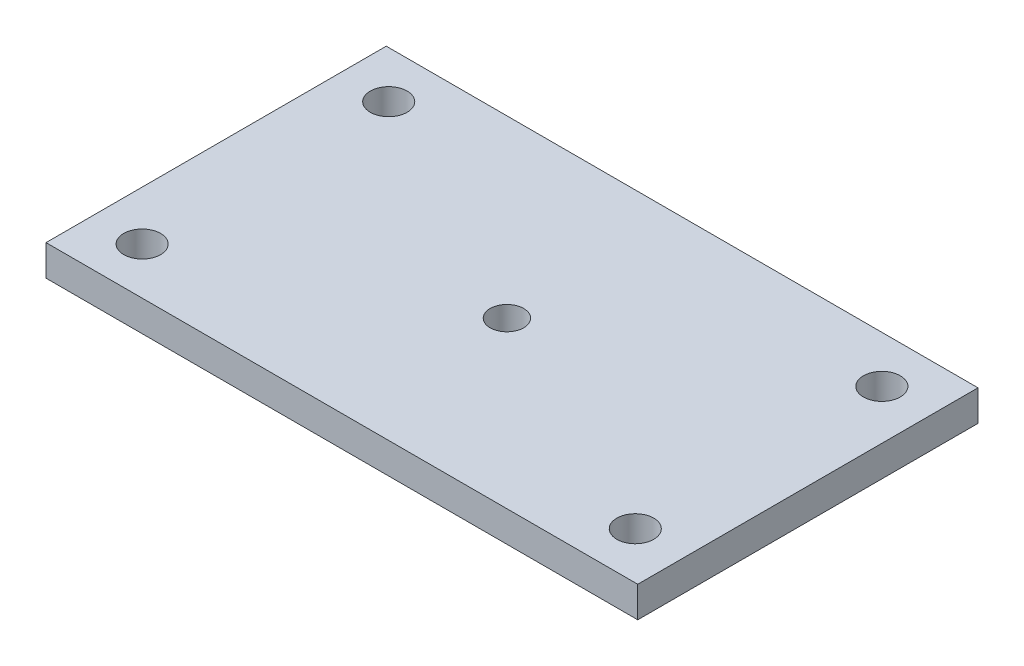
ISO-10303-21;
HEADER;
FILE_DESCRIPTION(('STEP AP214'),'2;1');
FILE_NAME('part.step','',(''),(''),'','','');
FILE_SCHEMA(('AUTOMOTIVE_DESIGN { 1 0 10303 214 1 1 1 1 }'));
ENDSEC;
DATA;
#1=APPLICATION_CONTEXT('core data for automotive mechanical design processes');
#2=APPLICATION_PROTOCOL_DEFINITION('international standard','automotive_design',2000,#1);
#3=PRODUCT_CONTEXT('',#1,'mechanical');
#4=PRODUCT('Part','Part','',(#3));
#5=PRODUCT_RELATED_PRODUCT_CATEGORY('part','',(#4));
#6=PRODUCT_DEFINITION_FORMATION('','',#4);
#7=PRODUCT_DEFINITION_CONTEXT('part definition',#1,'design');
#8=PRODUCT_DEFINITION('design','',#6,#7);
#9=PRODUCT_DEFINITION_SHAPE('','',#8);
#10=(LENGTH_UNIT() NAMED_UNIT(*) SI_UNIT(.MILLI.,.METRE.));
#11=(NAMED_UNIT(*) PLANE_ANGLE_UNIT() SI_UNIT($,.RADIAN.));
#12=(NAMED_UNIT(*) SI_UNIT($,.STERADIAN.) SOLID_ANGLE_UNIT());
#13=UNCERTAINTY_MEASURE_WITH_UNIT(LENGTH_MEASURE(1.E-05),#10,'distance_accuracy_value','');
#14=(GEOMETRIC_REPRESENTATION_CONTEXT(3) GLOBAL_UNCERTAINTY_ASSIGNED_CONTEXT((#13)) GLOBAL_UNIT_ASSIGNED_CONTEXT((#10,
#11,#12)) REPRESENTATION_CONTEXT('',''));
#15=CARTESIAN_POINT('',(0.,0.,0.));
#16=DIRECTION('',(0.,0.,1.));
#17=DIRECTION('',(1.,0.,0.));
#18=AXIS2_PLACEMENT_3D('',#15,#16,#17);
#19=CARTESIAN_POINT('',(-56.9504921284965,3.175,-18.0498827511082));
#20=DIRECTION('',(1.,0.,0.));
#21=DIRECTION('',(0.,0.,-1.));
#22=AXIS2_PLACEMENT_3D('',#19,#20,#21);
#23=PLANE('',#22);
#24=DIRECTION('',(0.,0.,1.));
#25=VECTOR('',#24,1.);
#26=CARTESIAN_POINT('',(-56.9504921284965,0.,-18.0498827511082));
#27=LINE('',#26,#25);
#28=CARTESIAN_POINT('',(-56.9504921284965,0.,-18.0498827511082));
#29=VERTEX_POINT('',#28);
#30=CARTESIAN_POINT('',(-56.9504921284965,0.,17.0021172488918));
#31=VERTEX_POINT('',#30);
#32=EDGE_CURVE('E105',#29,#31,#27,.T.);
#33=ORIENTED_EDGE('',*,*,#32,.T.);
#34=DIRECTION('',(0.,-1.,0.));
#35=VECTOR('',#34,1.);
#36=CARTESIAN_POINT('',(-56.9504921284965,3.175,17.0021172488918));
#37=LINE('',#36,#35);
#38=CARTESIAN_POINT('',(-56.9504921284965,3.175,17.0021172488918));
#39=VERTEX_POINT('',#38);
#40=EDGE_CURVE('E11',#39,#31,#37,.T.);
#41=ORIENTED_EDGE('',*,*,#40,.F.);
#42=DIRECTION('',(0.,0.,1.));
#43=VECTOR('',#42,1.);
#44=CARTESIAN_POINT('',(-56.9504921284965,3.175,-18.0498827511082));
#45=LINE('',#44,#43);
#46=CARTESIAN_POINT('',(-56.9504921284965,3.175,-18.0498827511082));
#47=VERTEX_POINT('',#46);
#48=EDGE_CURVE('E93',#47,#39,#45,.T.);
#49=ORIENTED_EDGE('',*,*,#48,.F.);
#50=DIRECTION('',(0.,-1.,0.));
#51=VECTOR('',#50,1.);
#52=CARTESIAN_POINT('',(-56.9504921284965,3.175,-18.0498827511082));
#53=LINE('',#52,#51);
#54=EDGE_CURVE('E101',#47,#29,#53,.T.);
#55=ORIENTED_EDGE('',*,*,#54,.T.);
#56=EDGE_LOOP('',(#33,#41,#49,#55));
#57=FACE_BOUND('',#56,.T.);
#58=ADVANCED_FACE('F42',(#57),#23,.F.);
#59=CARTESIAN_POINT('',(-56.9504921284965,3.175,17.0021172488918));
#60=DIRECTION('',(0.,0.,-1.));
#61=DIRECTION('',(-1.,0.,0.));
#62=AXIS2_PLACEMENT_3D('',#59,#60,#61);
#63=PLANE('',#62);
#64=DIRECTION('',(1.,0.,0.));
#65=VECTOR('',#64,1.);
#66=CARTESIAN_POINT('',(-56.9504921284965,0.,17.0021172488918));
#67=LINE('',#66,#65);
#68=CARTESIAN_POINT('',(4.00950787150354,0.,17.0021172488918));
#69=VERTEX_POINT('',#68);
#70=EDGE_CURVE('E97',#31,#69,#67,.T.);
#71=ORIENTED_EDGE('',*,*,#70,.T.);
#72=DIRECTION('',(0.,-1.,0.));
#73=VECTOR('',#72,1.);
#74=CARTESIAN_POINT('',(4.00950787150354,3.175,17.0021172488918));
#75=LINE('',#74,#73);
#76=CARTESIAN_POINT('',(4.00950787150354,3.175,17.0021172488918));
#77=VERTEX_POINT('',#76);
#78=EDGE_CURVE('E50',#77,#69,#75,.T.);
#79=ORIENTED_EDGE('',*,*,#78,.F.);
#80=DIRECTION('',(1.,0.,0.));
#81=VECTOR('',#80,1.);
#82=CARTESIAN_POINT('',(-56.9504921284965,3.175,17.0021172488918));
#83=LINE('',#82,#81);
#84=EDGE_CURVE('E88',#39,#77,#83,.T.);
#85=ORIENTED_EDGE('',*,*,#84,.F.);
#86=ORIENTED_EDGE('',*,*,#40,.T.);
#87=EDGE_LOOP('',(#71,#79,#85,#86));
#88=FACE_BOUND('',#87,.T.);
#89=ADVANCED_FACE('F96',(#88),#63,.F.);
#90=CARTESIAN_POINT('',(4.00950787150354,3.175,-18.0498827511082));
#91=DIRECTION('',(-1.,0.,0.));
#92=DIRECTION('',(0.,0.,1.));
#93=AXIS2_PLACEMENT_3D('',#90,#91,#92);
#94=PLANE('',#93);
#95=DIRECTION('',(0.,0.,-1.));
#96=VECTOR('',#95,1.);
#97=CARTESIAN_POINT('',(4.00950787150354,0.,-18.0498827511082));
#98=LINE('',#97,#96);
#99=CARTESIAN_POINT('',(4.00950787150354,0.,-18.0498827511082));
#100=VERTEX_POINT('',#99);
#101=EDGE_CURVE('E75',#69,#100,#98,.T.);
#102=ORIENTED_EDGE('',*,*,#101,.T.);
#103=DIRECTION('',(0.,-1.,0.));
#104=VECTOR('',#103,1.);
#105=CARTESIAN_POINT('',(4.00950787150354,3.175,-18.0498827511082));
#106=LINE('',#105,#104);
#107=CARTESIAN_POINT('',(4.00950787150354,3.175,-18.0498827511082));
#108=VERTEX_POINT('',#107);
#109=EDGE_CURVE('E98',#108,#100,#106,.T.);
#110=ORIENTED_EDGE('',*,*,#109,.F.);
#111=DIRECTION('',(0.,0.,-1.));
#112=VECTOR('',#111,1.);
#113=CARTESIAN_POINT('',(4.00950787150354,3.175,-18.0498827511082));
#114=LINE('',#113,#112);
#115=EDGE_CURVE('E91',#77,#108,#114,.T.);
#116=ORIENTED_EDGE('',*,*,#115,.F.);
#117=ORIENTED_EDGE('',*,*,#78,.T.);
#118=EDGE_LOOP('',(#102,#110,#116,#117));
#119=FACE_BOUND('',#118,.T.);
#120=ADVANCED_FACE('F99',(#119),#94,.F.);
#121=CARTESIAN_POINT('',(-56.9504921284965,3.175,-18.0498827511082));
#122=DIRECTION('',(0.,0.,1.));
#123=DIRECTION('',(1.,0.,0.));
#124=AXIS2_PLACEMENT_3D('',#121,#122,#123);
#125=PLANE('',#124);
#126=DIRECTION('',(-1.,0.,0.));
#127=VECTOR('',#126,1.);
#128=CARTESIAN_POINT('',(-56.9504921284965,0.,-18.0498827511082));
#129=LINE('',#128,#127);
#130=EDGE_CURVE('E81',#100,#29,#129,.T.);
#131=ORIENTED_EDGE('',*,*,#130,.T.);
#132=ORIENTED_EDGE('',*,*,#54,.F.);
#133=DIRECTION('',(-1.,0.,0.));
#134=VECTOR('',#133,1.);
#135=CARTESIAN_POINT('',(-56.9504921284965,3.175,-18.0498827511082));
#136=LINE('',#135,#134);
#137=EDGE_CURVE('E58',#108,#47,#136,.T.);
#138=ORIENTED_EDGE('',*,*,#137,.F.);
#139=ORIENTED_EDGE('',*,*,#109,.T.);
#140=EDGE_LOOP('',(#131,#132,#138,#139));
#141=FACE_BOUND('',#140,.T.);
#142=ADVANCED_FACE('F113',(#141),#125,.F.);
#143=CARTESIAN_POINT('',(0.,3.175,0.));
#144=DIRECTION('',(0.,1.,0.));
#145=DIRECTION('',(0.,0.,1.));
#146=AXIS2_PLACEMENT_3D('',#143,#144,#145);
#147=PLANE('',#146);
#148=CARTESIAN_POINT('',(-26.4704921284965,3.175,0.));
#149=DIRECTION('',(0.,-1.,0.));
#150=DIRECTION('',(0.,0.,-1.));
#151=AXIS2_PLACEMENT_3D('',#148,#149,#150);
#152=CIRCLE('',#151,1.7272);
#153=CARTESIAN_POINT('',(-26.4704921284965,3.175,-1.7272));
#154=VERTEX_POINT('',#153);
#155=EDGE_CURVE('E142',#154,#154,#152,.T.);
#156=ORIENTED_EDGE('',*,*,#155,.T.);
#157=EDGE_LOOP('',(#156));
#158=FACE_BOUND('',#157,.T.);
#159=CARTESIAN_POINT('',(-51.8704921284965,3.175,-13.2238827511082));
#160=DIRECTION('',(0.,1.,0.));
#161=DIRECTION('',(0.,0.,1.));
#162=AXIS2_PLACEMENT_3D('',#159,#160,#161);
#163=CIRCLE('',#162,1.89865);
#164=CARTESIAN_POINT('',(-51.8704921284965,3.175,-11.3252327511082));
#165=VERTEX_POINT('',#164);
#166=EDGE_CURVE('E139',#165,#165,#163,.T.);
#167=ORIENTED_EDGE('',*,*,#166,.F.);
#168=EDGE_LOOP('',(#167));
#169=FACE_BOUND('',#168,.T.);
#170=CARTESIAN_POINT('',(-1.07049212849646,3.175,-13.2238827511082));
#171=DIRECTION('',(0.,1.,0.));
#172=DIRECTION('',(0.,0.,1.));
#173=AXIS2_PLACEMENT_3D('',#170,#171,#172);
#174=CIRCLE('',#173,1.89865);
#175=CARTESIAN_POINT('',(-1.07049212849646,3.175,-11.3252327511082));
#176=VERTEX_POINT('',#175);
#177=EDGE_CURVE('E133',#176,#176,#174,.T.);
#178=ORIENTED_EDGE('',*,*,#177,.F.);
#179=EDGE_LOOP('',(#178));
#180=FACE_BOUND('',#179,.T.);
#181=CARTESIAN_POINT('',(-1.07049212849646,3.175,12.1761172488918));
#182=DIRECTION('',(0.,1.,0.));
#183=DIRECTION('',(0.,0.,1.));
#184=AXIS2_PLACEMENT_3D('',#181,#182,#183);
#185=CIRCLE('',#184,1.89865);
#186=CARTESIAN_POINT('',(-1.07049212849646,3.175,14.0747672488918));
#187=VERTEX_POINT('',#186);
#188=EDGE_CURVE('E127',#187,#187,#185,.T.);
#189=ORIENTED_EDGE('',*,*,#188,.F.);
#190=EDGE_LOOP('',(#189));
#191=FACE_BOUND('',#190,.T.);
#192=CARTESIAN_POINT('',(-51.8704921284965,3.175,12.1761172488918));
#193=DIRECTION('',(0.,1.,0.));
#194=DIRECTION('',(0.,0.,1.));
#195=AXIS2_PLACEMENT_3D('',#192,#193,#194);
#196=CIRCLE('',#195,1.89865);
#197=CARTESIAN_POINT('',(-51.8704921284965,3.175,14.0747672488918));
#198=VERTEX_POINT('',#197);
#199=EDGE_CURVE('E121',#198,#198,#196,.T.);
#200=ORIENTED_EDGE('',*,*,#199,.F.);
#201=EDGE_LOOP('',(#200));
#202=FACE_BOUND('',#201,.T.);
#203=ORIENTED_EDGE('',*,*,#48,.T.);
#204=ORIENTED_EDGE('',*,*,#84,.T.);
#205=ORIENTED_EDGE('',*,*,#115,.T.);
#206=ORIENTED_EDGE('',*,*,#137,.T.);
#207=EDGE_LOOP('',(#203,#204,#205,#206));
#208=FACE_BOUND('',#207,.T.);
#209=ADVANCED_FACE('F89',(#158,#169,#180,#191,#202,#208),#147,.T.);
#210=CARTESIAN_POINT('',(0.,0.,0.));
#211=DIRECTION('',(0.,1.,0.));
#212=DIRECTION('',(0.,0.,1.));
#213=AXIS2_PLACEMENT_3D('',#210,#211,#212);
#214=PLANE('',#213);
#215=CARTESIAN_POINT('',(-26.4704921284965,0.,0.));
#216=DIRECTION('',(0.,-1.,0.));
#217=DIRECTION('',(0.,0.,-1.));
#218=AXIS2_PLACEMENT_3D('',#215,#216,#217);
#219=CIRCLE('',#218,1.7272);
#220=CARTESIAN_POINT('',(-26.4704921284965,0.,-1.7272));
#221=VERTEX_POINT('',#220);
#222=EDGE_CURVE('E145',#221,#221,#219,.T.);
#223=ORIENTED_EDGE('',*,*,#222,.F.);
#224=EDGE_LOOP('',(#223));
#225=FACE_BOUND('',#224,.T.);
#226=CARTESIAN_POINT('',(-51.8704921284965,0.,-13.2238827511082));
#227=DIRECTION('',(0.,1.,0.));
#228=DIRECTION('',(0.,0.,1.));
#229=AXIS2_PLACEMENT_3D('',#226,#227,#228);
#230=CIRCLE('',#229,1.89865);
#231=CARTESIAN_POINT('',(-51.8704921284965,0.,-11.3252327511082));
#232=VERTEX_POINT('',#231);
#233=EDGE_CURVE('E136',#232,#232,#230,.T.);
#234=ORIENTED_EDGE('',*,*,#233,.T.);
#235=EDGE_LOOP('',(#234));
#236=FACE_BOUND('',#235,.T.);
#237=CARTESIAN_POINT('',(-1.07049212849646,0.,-13.2238827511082));
#238=DIRECTION('',(0.,1.,0.));
#239=DIRECTION('',(0.,0.,1.));
#240=AXIS2_PLACEMENT_3D('',#237,#238,#239);
#241=CIRCLE('',#240,1.89865);
#242=CARTESIAN_POINT('',(-1.07049212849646,0.,-11.3252327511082));
#243=VERTEX_POINT('',#242);
#244=EDGE_CURVE('E130',#243,#243,#241,.T.);
#245=ORIENTED_EDGE('',*,*,#244,.T.);
#246=EDGE_LOOP('',(#245));
#247=FACE_BOUND('',#246,.T.);
#248=CARTESIAN_POINT('',(-1.07049212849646,0.,12.1761172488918));
#249=DIRECTION('',(0.,1.,0.));
#250=DIRECTION('',(0.,0.,1.));
#251=AXIS2_PLACEMENT_3D('',#248,#249,#250);
#252=CIRCLE('',#251,1.89865);
#253=CARTESIAN_POINT('',(-1.07049212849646,0.,14.0747672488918));
#254=VERTEX_POINT('',#253);
#255=EDGE_CURVE('E124',#254,#254,#252,.T.);
#256=ORIENTED_EDGE('',*,*,#255,.T.);
#257=EDGE_LOOP('',(#256));
#258=FACE_BOUND('',#257,.T.);
#259=CARTESIAN_POINT('',(-51.8704921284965,0.,12.1761172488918));
#260=DIRECTION('',(0.,1.,0.));
#261=DIRECTION('',(0.,0.,1.));
#262=AXIS2_PLACEMENT_3D('',#259,#260,#261);
#263=CIRCLE('',#262,1.89865);
#264=CARTESIAN_POINT('',(-51.8704921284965,0.,14.0747672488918));
#265=VERTEX_POINT('',#264);
#266=EDGE_CURVE('E108',#265,#265,#263,.T.);
#267=ORIENTED_EDGE('',*,*,#266,.T.);
#268=EDGE_LOOP('',(#267));
#269=FACE_BOUND('',#268,.T.);
#270=ORIENTED_EDGE('',*,*,#32,.F.);
#271=ORIENTED_EDGE('',*,*,#130,.F.);
#272=ORIENTED_EDGE('',*,*,#101,.F.);
#273=ORIENTED_EDGE('',*,*,#70,.F.);
#274=EDGE_LOOP('',(#270,#271,#272,#273));
#275=FACE_BOUND('',#274,.T.);
#276=ADVANCED_FACE('F116',(#225,#236,#247,#258,#269,#275),#214,.F.);
#277=CARTESIAN_POINT('',(-51.8704921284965,3.175,12.1761172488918));
#278=DIRECTION('',(0.,1.,0.));
#279=DIRECTION('',(0.,0.,1.));
#280=AXIS2_PLACEMENT_3D('',#277,#278,#279);
#281=CYLINDRICAL_SURFACE('',#280,1.89865);
#282=ORIENTED_EDGE('',*,*,#266,.F.);
#283=EDGE_LOOP('',(#282));
#284=FACE_BOUND('',#283,.T.);
#285=ORIENTED_EDGE('',*,*,#199,.T.);
#286=EDGE_LOOP('',(#285));
#287=FACE_BOUND('',#286,.T.);
#288=ADVANCED_FACE('F153',(#284,#287),#281,.F.);
#289=CARTESIAN_POINT('',(-1.07049212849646,3.175,12.1761172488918));
#290=DIRECTION('',(0.,1.,0.));
#291=DIRECTION('',(0.,0.,1.));
#292=AXIS2_PLACEMENT_3D('',#289,#290,#291);
#293=CYLINDRICAL_SURFACE('',#292,1.89865);
#294=ORIENTED_EDGE('',*,*,#255,.F.);
#295=EDGE_LOOP('',(#294));
#296=FACE_BOUND('',#295,.T.);
#297=ORIENTED_EDGE('',*,*,#188,.T.);
#298=EDGE_LOOP('',(#297));
#299=FACE_BOUND('',#298,.T.);
#300=ADVANCED_FACE('F165',(#296,#299),#293,.F.);
#301=CARTESIAN_POINT('',(-1.07049212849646,3.175,-13.2238827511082));
#302=DIRECTION('',(0.,1.,0.));
#303=DIRECTION('',(0.,0.,1.));
#304=AXIS2_PLACEMENT_3D('',#301,#302,#303);
#305=CYLINDRICAL_SURFACE('',#304,1.89865);
#306=ORIENTED_EDGE('',*,*,#244,.F.);
#307=EDGE_LOOP('',(#306));
#308=FACE_BOUND('',#307,.T.);
#309=ORIENTED_EDGE('',*,*,#177,.T.);
#310=EDGE_LOOP('',(#309));
#311=FACE_BOUND('',#310,.T.);
#312=ADVANCED_FACE('F216',(#308,#311),#305,.F.);
#313=CARTESIAN_POINT('',(-51.8704921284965,3.175,-13.2238827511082));
#314=DIRECTION('',(0.,1.,0.));
#315=DIRECTION('',(0.,0.,1.));
#316=AXIS2_PLACEMENT_3D('',#313,#314,#315);
#317=CYLINDRICAL_SURFACE('',#316,1.89865);
#318=ORIENTED_EDGE('',*,*,#233,.F.);
#319=EDGE_LOOP('',(#318));
#320=FACE_BOUND('',#319,.T.);
#321=ORIENTED_EDGE('',*,*,#166,.T.);
#322=EDGE_LOOP('',(#321));
#323=FACE_BOUND('',#322,.T.);
#324=ADVANCED_FACE('F224',(#320,#323),#317,.F.);
#325=CARTESIAN_POINT('',(-26.4704921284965,0.,0.));
#326=DIRECTION('',(0.,-1.,0.));
#327=DIRECTION('',(0.,0.,-1.));
#328=AXIS2_PLACEMENT_3D('',#325,#326,#327);
#329=CYLINDRICAL_SURFACE('',#328,1.7272);
#330=ORIENTED_EDGE('',*,*,#155,.F.);
#331=EDGE_LOOP('',(#330));
#332=FACE_BOUND('',#331,.T.);
#333=ORIENTED_EDGE('',*,*,#222,.T.);
#334=EDGE_LOOP('',(#333));
#335=FACE_BOUND('',#334,.T.);
#336=ADVANCED_FACE('F149',(#332,#335),#329,.F.);
#337=CLOSED_SHELL('',(#58,#89,#120,#142,#209,#276,#288,#300,#312,#324,#336));
#338=MANIFOLD_SOLID_BREP('B2',#337);
#339=ADVANCED_BREP_SHAPE_REPRESENTATION('',(#18,#338),#14);
#340=SHAPE_DEFINITION_REPRESENTATION(#9,#339);
ENDSEC;
END-ISO-10303-21;
